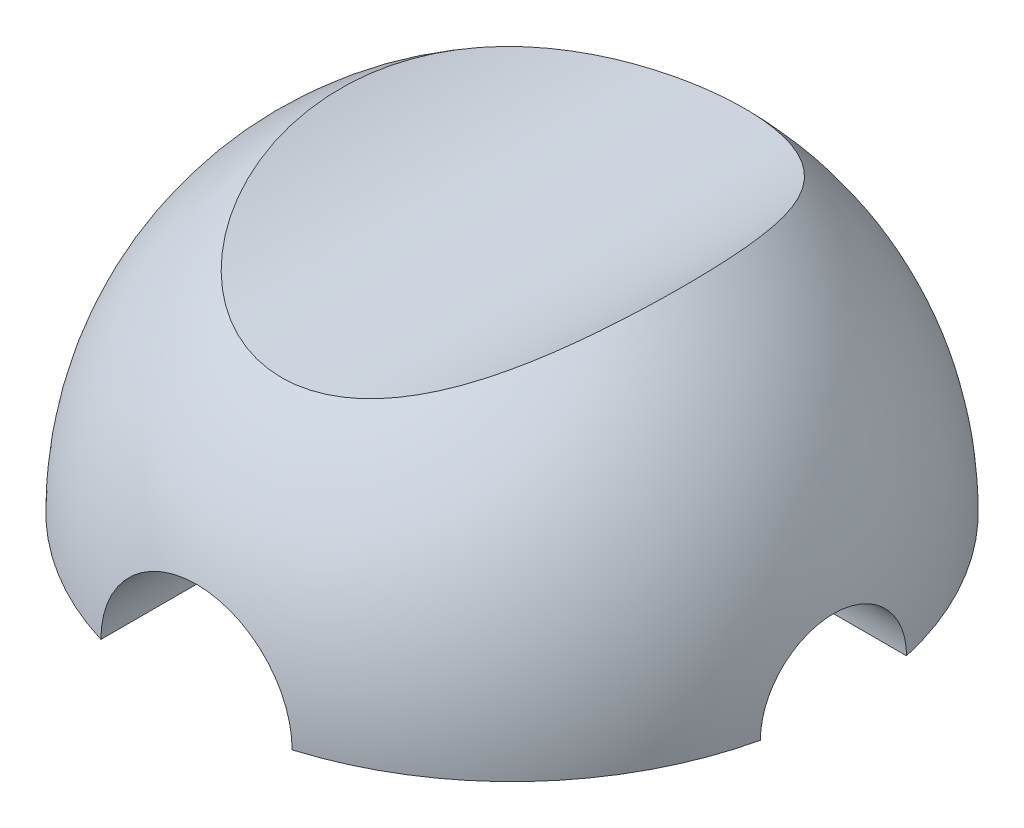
from build123d import *

# Parameters (mm, degrees)
RIVOLUZIONE1_ANGLE            = 180
TAGLIO_ESTRUSIONE5_DEPTH      = 98.079578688
TAGLIO_ESTRUSIONE5_DEPTH_BACK = 98.079578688
SCHIZZO3_R                    = 11.601613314
TAGLIO_ESTRUSIONE6_DEPTH      = 94.730440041
TAGLIO_ESTRUSIONE6_DEPTH_BACK = 94.730440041
SCHIZZO4_R                    = 8.871818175


with BuildPart() as part:
    # Schizzo1 → Rivoluzione1 (revolve)
    with BuildSketch(Plane(origin=(0, 0, 0), x_dir=(1, 0, 0), z_dir=(0, 1, 0))):
        with BuildLine():
            Line((-24.179692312, 60.872092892), (-24.179692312, -19.127907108))
            ThreePointArc((-24.179692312, -19.127907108), (15.820307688, 20.872092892), (-24.179692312, 60.872092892))
        make_face()
    revolve(axis=Axis((-24.179692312, 0, -60.872092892), (0, 0, 1)), revolution_arc=RIVOLUZIONE1_ANGLE)

    # Schizzo3 → Taglio-Estrusione5 (cut, two sides: drawn at the far end of the back side and taken through both)
    with BuildSketch(Plane.XY.offset(-TAGLIO_ESTRUSIONE5_DEPTH_BACK)):
        with Locations((-24.179692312, 0)):
            Circle(SCHIZZO3_R)
        with BuildLine():
            Line((-44.980554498, 34.166125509), (-3.378830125, 34.166125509))
            add(Edge.make_bspline(
                [(-44.980554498, 34.166125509), (-32.600950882, 26.705242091), (-15.717976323, 26.19743929), (-3.378830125, 34.166125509)],
                knots=[0, 0, 0, 0, 1, 1, 1, 1], degree=3))
        make_face()
    extrude(amount=TAGLIO_ESTRUSIONE5_DEPTH + TAGLIO_ESTRUSIONE5_DEPTH_BACK, mode=Mode.SUBTRACT)


with BuildPart() as taglio_estrusione5_kept_piece:
    # of the separate pieces the step leaves, the one the design keeps (taglio_estrusione5_pieces_kept)
    add(part.part.solids().sort_by_distance((-12.578078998, 0, 17.408484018))[0])

    # Schizzo4 → Taglio-Estrusione6 (cut, two sides: drawn at the far end of the back side and taken through both)
    with BuildSketch(Plane(origin=(0, 0, 0), x_dir=(0, 0, -1), z_dir=(1, 0, 0)).offset(-TAGLIO_ESTRUSIONE6_DEPTH_BACK)):
        with Locations((20.872092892, 0)):
            Circle(SCHIZZO4_R)
    extrude(amount=TAGLIO_ESTRUSIONE6_DEPTH + TAGLIO_ESTRUSIONE6_DEPTH_BACK, mode=Mode.SUBTRACT)

    # Schizzo6 → Taglia-Rivoluzione5 (revolve, cut)
    with BuildSketch(Plane(origin=(0, 0, 0), x_dir=(-1, 0, 0), z_dir=(0, -1, 0))):
        with BuildLine():
            Line((24.179692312, 48.819170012), (24.179692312, -7.074984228))
            ThreePointArc((24.179692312, -7.074984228), (52.126769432, 20.872092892), (24.179692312, 48.819170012))
        make_face()
    revolve(axis=Axis((-24.179692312, 0, -60.872092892), (0, 0, 1)), mode=Mode.SUBTRACT)


solid = taglio_estrusione5_kept_piece.part
